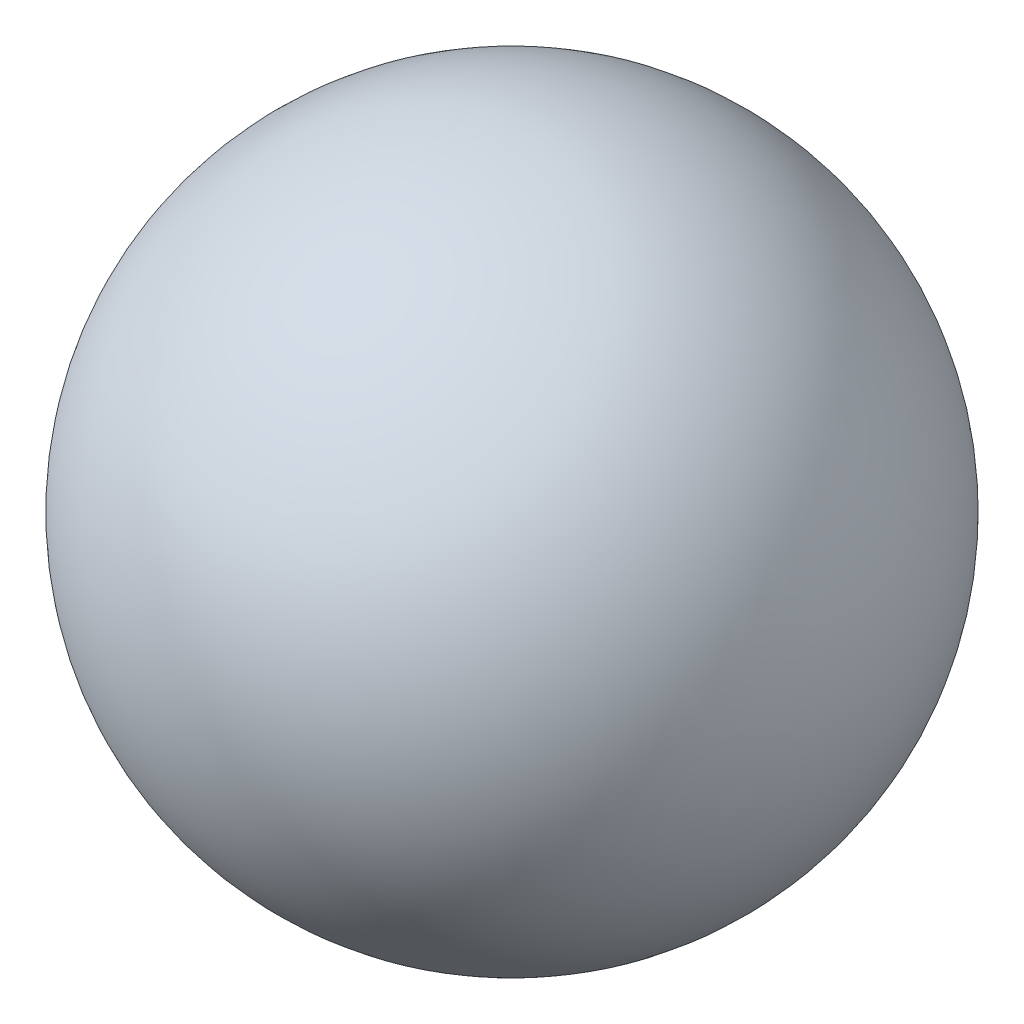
from build123d import *


with BuildPart() as part:
    # Sketch1 → Revolve2 (revolve)
    with BuildSketch(Plane.XY):
        with BuildLine():
            Line((0, -203.2), (0, 203.2))
            ThreePointArc((0, 203.2), (203.2, 0), (0, -203.2))
        make_face()
    revolve(axis=Axis((0, -223.52, 0), (0, 1, 0)))


solid = part.part
